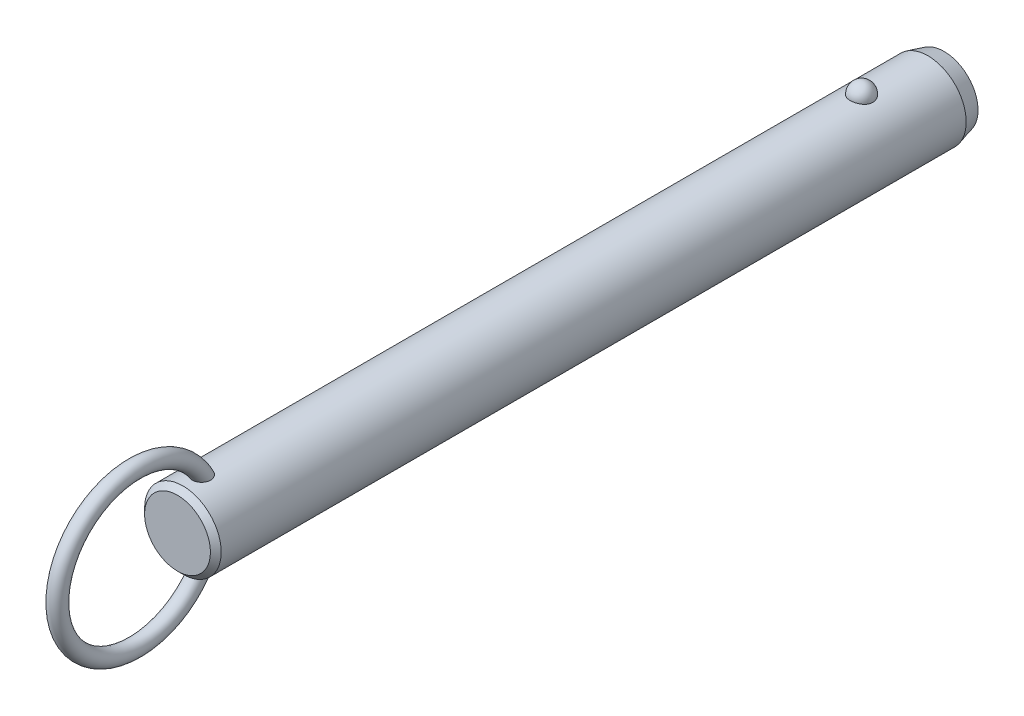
ISO-10303-21;
HEADER;
FILE_DESCRIPTION(('STEP AP214'),'2;1');
FILE_NAME('part.step','',(''),(''),'','','');
FILE_SCHEMA(('AUTOMOTIVE_DESIGN { 1 0 10303 214 1 1 1 1 }'));
ENDSEC;
DATA;
#1=APPLICATION_CONTEXT('core data for automotive mechanical design processes');
#2=APPLICATION_PROTOCOL_DEFINITION('international standard','automotive_design',2000,#1);
#3=PRODUCT_CONTEXT('',#1,'mechanical');
#4=PRODUCT('Part','Part','',(#3));
#5=PRODUCT_RELATED_PRODUCT_CATEGORY('part','',(#4));
#6=PRODUCT_DEFINITION_FORMATION('','',#4);
#7=PRODUCT_DEFINITION_CONTEXT('part definition',#1,'design');
#8=PRODUCT_DEFINITION('design','',#6,#7);
#9=PRODUCT_DEFINITION_SHAPE('','',#8);
#10=(LENGTH_UNIT() NAMED_UNIT(*) SI_UNIT(.MILLI.,.METRE.));
#11=(NAMED_UNIT(*) PLANE_ANGLE_UNIT() SI_UNIT($,.RADIAN.));
#12=(NAMED_UNIT(*) SI_UNIT($,.STERADIAN.) SOLID_ANGLE_UNIT());
#13=UNCERTAINTY_MEASURE_WITH_UNIT(LENGTH_MEASURE(1.E-05),#10,'distance_accuracy_value','');
#14=(GEOMETRIC_REPRESENTATION_CONTEXT(3) GLOBAL_UNCERTAINTY_ASSIGNED_CONTEXT((#13)) GLOBAL_UNIT_ASSIGNED_CONTEXT((#10,
#11,#12)) REPRESENTATION_CONTEXT('',''));
#15=CARTESIAN_POINT('',(0.,0.,0.));
#16=DIRECTION('',(0.,0.,1.));
#17=DIRECTION('',(1.,0.,0.));
#18=AXIS2_PLACEMENT_3D('',#15,#16,#17);
#19=CARTESIAN_POINT('',(0.,0.,116.8));
#20=DIRECTION('',(0.,0.,-1.));
#21=DIRECTION('',(-1.,0.,0.));
#22=AXIS2_PLACEMENT_3D('',#19,#20,#21);
#23=CYLINDRICAL_SURFACE('',#22,7.1);
#24=CARTESIAN_POINT('',(2.0769088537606,6.78943661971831,-2.1));
#25=CARTESIAN_POINT('',(2.07690739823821,6.78943796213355,-1.98268154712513));
#26=CARTESIAN_POINT('',(2.06738130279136,6.79237331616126,-1.86534506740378));
#27=CARTESIAN_POINT('',(2.0295040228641,6.8037853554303,-1.63400788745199));
#28=CARTESIAN_POINT('',(2.00114757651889,6.81226358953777,-1.52000812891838));
#29=CARTESIAN_POINT('',(1.92632025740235,6.83379798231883,-1.29863433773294));
#30=CARTESIAN_POINT('',(1.87985726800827,6.84685214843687,-1.19125744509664));
#31=CARTESIAN_POINT('',(1.76995205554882,6.87608091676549,-0.98604657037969));
#32=CARTESIAN_POINT('',(1.70650980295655,6.8922555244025,-0.88821260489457));
#33=CARTESIAN_POINT('',(1.5638119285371,6.92602930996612,-0.704242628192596));
#34=CARTESIAN_POINT('',(1.4844714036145,6.94363582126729,-0.618173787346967));
#35=CARTESIAN_POINT('',(1.31221746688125,6.97823658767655,-0.460740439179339));
#36=CARTESIAN_POINT('',(1.21930409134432,6.99523084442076,-0.389375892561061));
#37=CARTESIAN_POINT('',(1.02268781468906,7.02666176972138,-0.263547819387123));
#38=CARTESIAN_POINT('',(0.91902009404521,7.04110638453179,-0.209031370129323));
#39=CARTESIAN_POINT('',(0.703548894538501,7.06588726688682,-0.118163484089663));
#40=CARTESIAN_POINT('',(0.591746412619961,7.07622403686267,-0.0818098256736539));
#41=CARTESIAN_POINT('',(0.365557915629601,7.09147068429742,-0.0288711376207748));
#42=CARTESIAN_POINT('',(0.251267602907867,7.09648447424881,-0.0119070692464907));
#43=CARTESIAN_POINT('',(0.0213499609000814,7.10089837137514,0.00304925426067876));
#44=CARTESIAN_POINT('',(-0.0942772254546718,7.10029907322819,0.00104351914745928));
#45=CARTESIAN_POINT('',(-0.321651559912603,7.09360829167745,-0.0216931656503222));
#46=CARTESIAN_POINT('',(-0.433431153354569,7.08760388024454,-0.0421272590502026));
#47=CARTESIAN_POINT('',(-0.651862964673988,7.07086131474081,-0.100729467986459));
#48=CARTESIAN_POINT('',(-0.758515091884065,7.06012307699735,-0.138897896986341));
#49=CARTESIAN_POINT('',(-0.964449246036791,7.03496097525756,-0.232213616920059));
#50=CARTESIAN_POINT('',(-1.06368095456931,7.02051445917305,-0.287465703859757));
#51=CARTESIAN_POINT('',(-1.25145353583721,6.98948740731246,-0.413383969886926));
#52=CARTESIAN_POINT('',(-1.33999321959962,6.97290663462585,-0.48405186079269));
#53=CARTESIAN_POINT('',(-1.50591604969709,6.93898770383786,-0.640594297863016));
#54=CARTESIAN_POINT('',(-1.58302488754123,6.92164094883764,-0.726757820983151));
#55=CARTESIAN_POINT('',(-1.72189320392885,6.8884103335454,-0.91092752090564));
#56=CARTESIAN_POINT('',(-1.78365144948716,6.87252659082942,-1.008934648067));
#57=CARTESIAN_POINT('',(-1.89101272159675,6.84377189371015,-1.21549497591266));
#58=CARTESIAN_POINT('',(-1.93639553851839,6.83094274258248,-1.32416860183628));
#59=CARTESIAN_POINT('',(-2.00874275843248,6.81002070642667,-1.54791500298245));
#60=CARTESIAN_POINT('',(-2.03570774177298,6.80192767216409,-1.66298757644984));
#61=CARTESIAN_POINT('',(-2.07047276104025,6.7914266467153,-1.89571453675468));
#62=CARTESIAN_POINT('',(-2.07835878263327,6.78899315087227,-2.01335491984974));
#63=CARTESIAN_POINT('',(-2.07502083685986,6.79001409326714,-2.24833570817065));
#64=CARTESIAN_POINT('',(-2.06379746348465,6.7934683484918,-2.36567612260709));
#65=CARTESIAN_POINT('',(-2.02263913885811,6.80583442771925,-2.59603194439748));
#66=CARTESIAN_POINT('',(-1.99281127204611,6.81471501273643,-2.70906820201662));
#67=CARTESIAN_POINT('',(-1.91526639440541,6.83691232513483,-2.92836575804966));
#68=CARTESIAN_POINT('',(-1.8675486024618,6.85022924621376,-3.03462676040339));
#69=CARTESIAN_POINT('',(-1.75504492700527,6.87991336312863,-3.23806487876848));
#70=CARTESIAN_POINT('',(-1.69015924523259,6.89629822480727,-3.33518422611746));
#71=CARTESIAN_POINT('',(-1.54505404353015,6.93024852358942,-3.51697105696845));
#72=CARTESIAN_POINT('',(-1.46483385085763,6.94781401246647,-3.60163799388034));
#73=CARTESIAN_POINT('',(-1.29071406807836,6.98225977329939,-3.75654119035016));
#74=CARTESIAN_POINT('',(-1.19675650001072,6.99913673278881,-3.82671308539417));
#75=CARTESIAN_POINT('',(-0.997940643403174,7.03023618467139,-3.9501837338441));
#76=CARTESIAN_POINT('',(-0.89308318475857,7.04445887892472,-4.00348377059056));
#77=CARTESIAN_POINT('',(-0.676902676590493,7.06848365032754,-4.09107242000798));
#78=CARTESIAN_POINT('',(-0.565686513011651,7.0783430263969,-4.12560889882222));
#79=CARTESIAN_POINT('',(-0.338739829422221,7.09282534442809,-4.17575450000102));
#80=CARTESIAN_POINT('',(-0.223009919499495,7.09744899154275,-4.19136617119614));
#81=CARTESIAN_POINT('',(0.00707628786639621,7.10090930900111,-4.20307965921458));
#82=CARTESIAN_POINT('',(0.121410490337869,7.09986531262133,-4.19958377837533));
#83=CARTESIAN_POINT('',(0.347815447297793,7.092380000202,-4.17411564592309));
#84=CARTESIAN_POINT('',(0.459886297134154,7.08593891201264,-4.15214417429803));
#85=CARTESIAN_POINT('',(0.678084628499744,7.06838983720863,-4.09049562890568));
#86=CARTESIAN_POINT('',(0.784237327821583,7.05730369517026,-4.05090137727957));
#87=CARTESIAN_POINT('',(0.988305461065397,7.03163139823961,-3.95511447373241));
#88=CARTESIAN_POINT('',(1.08622031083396,7.01704499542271,-3.89892064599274));
#89=CARTESIAN_POINT('',(1.27284490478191,6.98562668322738,-3.77035541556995));
#90=CARTESIAN_POINT('',(1.36137372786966,6.96876135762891,-3.69772964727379));
#91=CARTESIAN_POINT('',(1.52509486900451,6.93477412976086,-3.53878279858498));
#92=CARTESIAN_POINT('',(1.60028496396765,6.91765218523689,-3.45245943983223));
#93=CARTESIAN_POINT('',(1.73681688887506,6.88465753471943,-3.26658774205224));
#94=CARTESIAN_POINT('',(1.79785966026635,6.86881574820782,-3.16681408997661));
#95=CARTESIAN_POINT('',(1.90265327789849,6.84053157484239,-2.95814408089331));
#96=CARTESIAN_POINT('',(1.94640861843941,6.82808830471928,-2.84925010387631));
#97=CARTESIAN_POINT('',(2.01274378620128,6.80881460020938,-2.63454318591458));
#98=CARTESIAN_POINT('',(2.03676193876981,6.80160856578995,-2.52920574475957));
#99=CARTESIAN_POINT('',(2.06884490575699,6.79191902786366,-2.3159172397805));
#100=CARTESIAN_POINT('',(2.07691019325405,6.78943538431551,-2.20796625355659));
#101=CARTESIAN_POINT('',(2.0769088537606,6.78943661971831,-2.1));
#102=B_SPLINE_CURVE_WITH_KNOTS('',3,(#24,#25,#26,#27,#28,#29,#30,#31,#32,#33,#34,#35,#36,#37,
#38,#39,#40,#41,#42,#43,#44,#45,#46,#47,#48,#49,#50,#51,#52,#53,#54,#55,#56,#57,#58,#59,#60,#61,
#62,#63,#64,#65,#66,#67,#68,#69,#70,#71,#72,#73,#74,#75,#76,#77,#78,#79,#80,#81,#82,#83,#84,#85,
#86,#87,#88,#89,#90,#91,#92,#93,#94,#95,#96,#97,#98,#99,#100,#101),.UNSPECIFIED.,.T.,.F.,(4,2,2,
2,2,2,2,2,2,2,2,2,2,2,2,2,2,2,2,2,2,2,2,2,2,2,2,2,2,2,2,2,2,2,2,2,2,2,4),(0.,0.351568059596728,
0.703234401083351,1.05474780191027,1.40626181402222,1.75970563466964,2.11314851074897,
2.4654696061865,2.81774759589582,3.16301449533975,3.50824481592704,3.84801136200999,
4.18778391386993,4.52968352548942,4.87162112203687,5.22076181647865,5.56993054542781,
5.92363364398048,6.27732559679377,6.62942052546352,6.98150450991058,7.33158042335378,
7.68167162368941,8.03384443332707,8.38603269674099,8.73975272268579,9.09344583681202,
9.44234545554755,9.79119807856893,10.1327344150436,10.4742563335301,10.8141898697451,
11.1541474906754,11.4997793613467,11.8454687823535,12.1979079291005,12.5502553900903,
12.8738073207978,13.1973496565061),.UNSPECIFIED.);
#103=CARTESIAN_POINT('',(2.0769088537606,6.78943661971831,-2.1));
#104=VERTEX_POINT('',#103);
#105=EDGE_CURVE('E41',#104,#104,#102,.T.);
#106=ORIENTED_EDGE('',*,*,#105,.T.);
#107=EDGE_LOOP('',(#106));
#108=FACE_BOUND('',#107,.T.);
#109=CARTESIAN_POINT('',(0.,0.,123.72));
#110=DIRECTION('',(0.,0.,1.));
#111=DIRECTION('',(1.,0.,0.));
#112=AXIS2_PLACEMENT_3D('',#109,#110,#111);
#113=CIRCLE('',#112,7.1);
#114=CARTESIAN_POINT('',(7.1,0.,123.72));
#115=VERTEX_POINT('',#114);
#116=EDGE_CURVE('E10',#115,#115,#113,.F.);
#117=ORIENTED_EDGE('',*,*,#116,.T.);
#118=EDGE_LOOP('',(#117));
#119=FACE_BOUND('',#118,.T.);
#120=CARTESIAN_POINT('',(-0.429539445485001,-7.08699541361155,118.542921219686));
#121=CARTESIAN_POINT('',(-0.508331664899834,-7.08221999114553,118.566876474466));
#122=CARTESIAN_POINT('',(-0.585039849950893,-7.07624016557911,118.597457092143));
#123=CARTESIAN_POINT('',(-0.732082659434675,-7.06254296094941,118.671024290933));
#124=CARTESIAN_POINT('',(-0.802417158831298,-7.05482554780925,118.714011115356));
#125=CARTESIAN_POINT('',(-0.934722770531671,-7.03851844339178,118.811113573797));
#126=CARTESIAN_POINT('',(-0.996700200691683,-7.02992941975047,118.865220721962));
#127=CARTESIAN_POINT('',(-1.11079942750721,-7.01280697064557,118.982967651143));
#128=CARTESIAN_POINT('',(-1.16292136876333,-7.00427354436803,119.046607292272));
#129=CARTESIAN_POINT('',(-1.25705660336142,-6.98799959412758,119.182687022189));
#130=CARTESIAN_POINT('',(-1.2988803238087,-6.98027525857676,119.255259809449));
#131=CARTESIAN_POINT('',(-1.37069920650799,-6.96652886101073,119.406168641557));
#132=CARTESIAN_POINT('',(-1.40069157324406,-6.96050720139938,119.484506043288));
#133=CARTESIAN_POINT('',(-1.45043507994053,-6.95031881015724,119.650190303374));
#134=CARTESIAN_POINT('',(-1.46937115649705,-6.94630231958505,119.737789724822));
#135=CARTESIAN_POINT('',(-1.49424917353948,-6.94099239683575,119.914871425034));
#136=CARTESIAN_POINT('',(-1.50018601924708,-6.93970003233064,120.004354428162));
#137=CARTESIAN_POINT('',(-1.49978214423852,-6.93978815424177,120.194060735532));
#138=CARTESIAN_POINT('',(-1.49187639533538,-6.94150934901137,120.294279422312));
#139=CARTESIAN_POINT('',(-1.46177925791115,-6.94790814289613,120.492479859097));
#140=CARTESIAN_POINT('',(-1.43957541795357,-6.95258831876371,120.590459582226));
#141=CARTESIAN_POINT('',(-1.37783293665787,-6.96510647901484,120.79536292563));
#142=CARTESIAN_POINT('',(-1.33634073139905,-6.97328848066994,120.901680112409));
#143=CARTESIAN_POINT('',(-1.23686994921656,-6.99161706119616,121.106177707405));
#144=CARTESIAN_POINT('',(-1.17889192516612,-7.00176357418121,121.204358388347));
#145=CARTESIAN_POINT('',(-1.05875124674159,-7.02082898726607,121.372374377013));
#146=CARTESIAN_POINT('',(-0.999247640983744,-7.02963746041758,121.444123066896));
#147=CARTESIAN_POINT('',(-0.869494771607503,-7.04686074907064,121.577195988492));
#148=CARTESIAN_POINT('',(-0.799263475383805,-7.05527619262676,121.638537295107));
#149=CARTESIAN_POINT('',(-0.665408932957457,-7.06899457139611,121.735131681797));
#150=CARTESIAN_POINT('',(-0.603817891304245,-7.07457275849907,121.773151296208));
#151=CARTESIAN_POINT('',(-0.47517283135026,-7.08437420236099,121.838758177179));
#152=CARTESIAN_POINT('',(-0.408123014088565,-7.08859848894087,121.866353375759));
#153=CARTESIAN_POINT('',(-0.269431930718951,-7.09522749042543,121.909256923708));
#154=CARTESIAN_POINT('',(-0.19775731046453,-7.09761688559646,121.924461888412));
#155=CARTESIAN_POINT('',(-0.05278498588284,-7.10017268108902,121.940716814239));
#156=CARTESIAN_POINT('',(0.0205115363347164,-7.10034065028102,121.941776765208));
#157=CARTESIAN_POINT('',(0.156426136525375,-7.09855986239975,121.930461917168));
#158=CARTESIAN_POINT('',(0.219199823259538,-7.09688191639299,121.919806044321));
#159=CARTESIAN_POINT('',(0.342134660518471,-7.09201880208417,121.888537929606));
#160=CARTESIAN_POINT('',(0.402295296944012,-7.08883333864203,121.867923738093));
#161=CARTESIAN_POINT('',(0.520687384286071,-7.08113868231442,121.817212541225));
#162=CARTESIAN_POINT('',(0.57879126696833,-7.07658958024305,121.786827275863));
#163=CARTESIAN_POINT('',(0.690173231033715,-7.06659708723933,121.718367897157));
#164=CARTESIAN_POINT('',(0.74344785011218,-7.061153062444,121.680288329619));
#165=CARTESIAN_POINT('',(0.870947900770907,-7.04680292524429,121.576592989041));
#166=CARTESIAN_POINT('',(0.941828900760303,-7.0375580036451,121.506897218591));
#167=CARTESIAN_POINT('',(1.07136606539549,-7.01900793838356,121.356945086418));
#168=CARTESIAN_POINT('',(1.13000013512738,-7.00970271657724,121.276670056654));
#169=CARTESIAN_POINT('',(1.23579584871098,-6.99183327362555,121.106899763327));
#170=CARTESIAN_POINT('',(1.28274271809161,-6.98328455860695,121.017269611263));
#171=CARTESIAN_POINT('',(1.36351442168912,-6.96796352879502,120.832176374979));
#172=CARTESIAN_POINT('',(1.39733971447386,-6.96119115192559,120.736713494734));
#173=CARTESIAN_POINT('',(1.45579181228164,-6.94922464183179,120.52530928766));
#174=CARTESIAN_POINT('',(1.47790145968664,-6.94449000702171,120.408631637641));
#175=CARTESIAN_POINT('',(1.50168752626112,-6.93938731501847,120.173015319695));
#176=CARTESIAN_POINT('',(1.50336085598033,-6.93901991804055,120.05407631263));
#177=CARTESIAN_POINT('',(1.48486516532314,-6.9430010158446,119.82360799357));
#178=CARTESIAN_POINT('',(1.46573441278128,-6.9471253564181,119.711995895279));
#179=CARTESIAN_POINT('',(1.40606892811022,-6.95944667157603,119.494886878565));
#180=CARTESIAN_POINT('',(1.36556446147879,-6.96763788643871,119.3893815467));
#181=CARTESIAN_POINT('',(1.27082700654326,-6.98548038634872,119.204287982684));
#182=CARTESIAN_POINT('',(1.21949810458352,-6.99473841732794,119.123171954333));
#183=CARTESIAN_POINT('',(1.10242050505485,-7.01414069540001,118.972227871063));
#184=CARTESIAN_POINT('',(1.0366811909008,-7.02428436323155,118.90239252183));
#185=CARTESIAN_POINT('',(0.900559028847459,-7.04295285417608,118.783573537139));
#186=CARTESIAN_POINT('',(0.831428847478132,-7.05153466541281,118.733157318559));
#187=CARTESIAN_POINT('',(0.685291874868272,-7.06723150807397,118.645142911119));
#188=CARTESIAN_POINT('',(0.608287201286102,-7.0743469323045,118.607541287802));
#189=CARTESIAN_POINT('',(0.45187890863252,-7.08602232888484,118.547491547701));
#190=CARTESIAN_POINT('',(0.372686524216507,-7.09067127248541,118.524508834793));
#191=CARTESIAN_POINT('',(0.211477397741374,-7.09730788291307,118.492035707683));
#192=CARTESIAN_POINT('',(0.12946098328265,-7.09929585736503,118.48254373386));
#193=CARTESIAN_POINT('',(-0.0332905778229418,-7.10037858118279,118.477351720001));
#194=CARTESIAN_POINT('',(-0.114016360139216,-7.09953334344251,118.481365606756));
#195=CARTESIAN_POINT('',(-0.273670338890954,-7.09517338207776,118.502454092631));
#196=CARTESIAN_POINT('',(-0.352598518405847,-7.09165863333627,118.519528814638));
#197=CARTESIAN_POINT('',(-0.429539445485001,-7.08699541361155,118.542921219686));
#198=B_SPLINE_CURVE_WITH_KNOTS('',3,(#120,#121,#122,#123,#124,#125,#126,#127,#128,#129,#130,
#131,#132,#133,#134,#135,#136,#137,#138,#139,#140,#141,#142,#143,#144,#145,#146,#147,#148,#149,
#150,#151,#152,#153,#154,#155,#156,#157,#158,#159,#160,#161,#162,#163,#164,#165,#166,#167,#168,
#169,#170,#171,#172,#173,#174,#175,#176,#177,#178,#179,#180,#181,#182,#183,#184,#185,#186,#187,
#188,#189,#190,#191,#192,#193,#194,#195,#196,#197),.UNSPECIFIED.,.T.,.F.,(4,2,2,2,2,2,2,2,2,2,2,
2,2,2,2,2,2,2,2,2,2,2,2,2,2,2,2,2,2,2,2,2,2,2,2,2,2,2,4),(0.,0.247183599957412,
0.494372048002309,0.741372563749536,0.988369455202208,1.23962059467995,1.49093106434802,
1.75897818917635,2.02713035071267,2.32758265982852,2.62829697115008,2.97008736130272,
3.31186629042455,3.59175319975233,3.87117637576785,4.08813841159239,4.30493502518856,
4.52352259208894,4.7419557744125,4.93215328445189,5.12238804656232,5.31884850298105,
5.51544871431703,5.81332317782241,6.11173048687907,6.41527266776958,6.71880423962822,
7.073581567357,7.42841252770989,7.76631485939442,8.10373999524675,8.39142246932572,
8.67891817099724,8.9356033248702,9.19221962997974,9.43881106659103,9.68537399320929,
9.92674752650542,10.1681233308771),.UNSPECIFIED.);
#199=CARTESIAN_POINT('',(-0.429539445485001,-7.08699541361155,118.542921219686));
#200=VERTEX_POINT('',#199);
#201=EDGE_CURVE('E58',#200,#200,#198,.T.);
#202=ORIENTED_EDGE('',*,*,#201,.T.);
#203=EDGE_LOOP('',(#202));
#204=FACE_BOUND('',#203,.T.);
#205=CARTESIAN_POINT('',(-0.429539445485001,7.08699541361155,118.542921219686));
#206=CARTESIAN_POINT('',(-0.351665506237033,7.09171429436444,118.519246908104));
#207=CARTESIAN_POINT('',(-0.271733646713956,7.09525896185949,118.502036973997));
#208=CARTESIAN_POINT('',(-0.11002645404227,7.09960839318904,118.481005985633));
#209=CARTESIAN_POINT('',(-0.0282502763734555,7.10041187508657,118.477191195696));
#210=CARTESIAN_POINT('',(0.134782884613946,7.09918849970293,118.483059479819));
#211=CARTESIAN_POINT('',(0.21603995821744,7.09716214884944,118.49274013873));
#212=CARTESIAN_POINT('',(0.375730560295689,7.09050177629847,118.525347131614));
#213=CARTESIAN_POINT('',(0.454164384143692,7.08586802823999,118.548272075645));
#214=CARTESIAN_POINT('',(0.606025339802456,7.07449911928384,118.606771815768));
#215=CARTESIAN_POINT('',(0.679451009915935,7.06776334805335,118.642350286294));
#216=CARTESIAN_POINT('',(0.819234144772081,7.05292866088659,118.725175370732));
#217=CARTESIAN_POINT('',(0.885591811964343,7.04482978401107,118.772421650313));
#218=CARTESIAN_POINT('',(1.00993211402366,7.02808709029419,118.877590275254));
#219=CARTESIAN_POINT('',(1.06785399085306,7.01943990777,118.935583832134));
#220=CARTESIAN_POINT('',(1.17342527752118,7.00256662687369,119.060301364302));
#221=CARTESIAN_POINT('',(1.22107408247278,6.99434055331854,119.127025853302));
#222=CARTESIAN_POINT('',(1.30652927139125,6.97889183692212,119.269362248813));
#223=CARTESIAN_POINT('',(1.34399711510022,6.97170674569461,119.345180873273));
#224=CARTESIAN_POINT('',(1.40682616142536,6.95930080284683,119.501810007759));
#225=CARTESIAN_POINT('',(1.43218374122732,6.95408053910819,119.58262200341));
#226=CARTESIAN_POINT('',(1.47246409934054,6.94566853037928,119.753531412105));
#227=CARTESIAN_POINT('',(1.48642590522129,6.9426653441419,119.84386307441));
#228=CARTESIAN_POINT('',(1.5011410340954,6.93949744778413,120.025619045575));
#229=CARTESIAN_POINT('',(1.50188917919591,6.93933385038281,120.117043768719));
#230=CARTESIAN_POINT('',(1.49030464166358,6.94183245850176,120.31084381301));
#231=CARTESIAN_POINT('',(1.47627413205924,6.94486147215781,120.413112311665));
#232=CARTESIAN_POINT('',(1.43356351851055,6.95380194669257,120.614471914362));
#233=CARTESIAN_POINT('',(1.4048676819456,6.95971650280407,120.713559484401));
#234=CARTESIAN_POINT('',(1.32908750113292,6.97461208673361,120.918908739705));
#235=CARTESIAN_POINT('',(1.28011435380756,6.98388945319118,121.024456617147));
#236=CARTESIAN_POINT('',(1.16520357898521,7.00397743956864,121.225760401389));
#237=CARTESIAN_POINT('',(1.09927694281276,7.01478706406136,121.321522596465));
#238=CARTESIAN_POINT('',(0.969361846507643,7.03373936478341,121.476756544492));
#239=CARTESIAN_POINT('',(0.909042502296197,7.04187023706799,121.539303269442));
#240=CARTESIAN_POINT('',(0.779178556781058,7.05741732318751,121.654053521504));
#241=CARTESIAN_POINT('',(0.709649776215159,7.06483472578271,121.706274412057));
#242=CARTESIAN_POINT('',(0.576854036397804,7.0767751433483,121.788113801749));
#243=CARTESIAN_POINT('',(0.515118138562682,7.08158033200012,121.820164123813));
#244=CARTESIAN_POINT('',(0.387127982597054,7.08972701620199,121.873765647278));
#245=CARTESIAN_POINT('',(0.320877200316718,7.09306962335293,121.895324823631));
#246=CARTESIAN_POINT('',(0.18504126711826,7.09791507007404,121.926400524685));
#247=CARTESIAN_POINT('',(0.115437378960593,7.09940591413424,121.935838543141));
#248=CARTESIAN_POINT('',(-0.0243157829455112,7.10030171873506,121.941522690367));
#249=CARTESIAN_POINT('',(-0.0944648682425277,7.0997073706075,121.937773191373));
#250=CARTESIAN_POINT('',(-0.225713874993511,7.09668414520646,121.918508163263));
#251=CARTESIAN_POINT('',(-0.287006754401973,7.09444865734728,121.904232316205));
#252=CARTESIAN_POINT('',(-0.40655537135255,7.08860360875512,121.866368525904));
#253=CARTESIAN_POINT('',(-0.464809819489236,7.08499346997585,121.842776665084));
#254=CARTESIAN_POINT('',(-0.594955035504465,7.07541654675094,121.778923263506));
#255=CARTESIAN_POINT('',(-0.665389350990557,7.06906574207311,121.735753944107));
#256=CARTESIAN_POINT('',(-0.798242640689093,7.05530261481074,121.638587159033));
#257=CARTESIAN_POINT('',(-0.860645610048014,7.0478882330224,121.584568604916));
#258=CARTESIAN_POINT('',(-0.99424943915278,7.03045217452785,121.450996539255));
#259=CARTESIAN_POINT('',(-1.06260129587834,7.02030745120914,121.368614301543));
#260=CARTESIAN_POINT('',(-1.18502045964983,7.00068382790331,121.193843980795));
#261=CARTESIAN_POINT('',(-1.239076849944,6.99120544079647,121.101448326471));
#262=CARTESIAN_POINT('',(-1.33335589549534,6.97384343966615,120.908008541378));
#263=CARTESIAN_POINT('',(-1.3733613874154,6.96598557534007,120.806856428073));
#264=CARTESIAN_POINT('',(-1.43770677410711,6.9529905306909,120.599504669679));
#265=CARTESIAN_POINT('',(-1.46204473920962,6.94785368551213,120.49330440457));
#266=CARTESIAN_POINT('',(-1.49537533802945,6.94076296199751,120.268231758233));
#267=CARTESIAN_POINT('',(-1.50273564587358,6.93914842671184,120.14909751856));
#268=CARTESIAN_POINT('',(-1.4954555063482,6.94072368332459,119.911470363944));
#269=CARTESIAN_POINT('',(-1.48082914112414,6.94391040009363,119.792977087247));
#270=CARTESIAN_POINT('',(-1.43076401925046,6.95438579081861,119.573432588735));
#271=CARTESIAN_POINT('',(-1.39762227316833,6.96121852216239,119.471841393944));
#272=CARTESIAN_POINT('',(-1.31211274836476,6.97783941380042,119.277351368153));
#273=CARTESIAN_POINT('',(-1.2597660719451,6.98762432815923,119.18444313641));
#274=CARTESIAN_POINT('',(-1.14583073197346,7.00713153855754,119.024160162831));
#275=CARTESIAN_POINT('',(-1.0866594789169,7.01665982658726,118.955035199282));
#276=CARTESIAN_POINT('',(-0.956606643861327,7.03556646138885,118.828878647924));
#277=CARTESIAN_POINT('',(-0.885737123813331,7.04494495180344,118.771834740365));
#278=CARTESIAN_POINT('',(-0.751558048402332,7.06035735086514,118.683100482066));
#279=CARTESIAN_POINT('',(-0.690120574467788,7.0666695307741,118.648593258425));
#280=CARTESIAN_POINT('',(-0.562815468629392,7.07794609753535,118.588750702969));
#281=CARTESIAN_POINT('',(-0.496948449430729,7.08291067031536,118.563414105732));
#282=CARTESIAN_POINT('',(-0.429539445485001,7.08699541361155,118.542921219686));
#283=B_SPLINE_CURVE_WITH_KNOTS('',3,(#205,#206,#207,#208,#209,#210,#211,#212,#213,#214,#215,
#216,#217,#218,#219,#220,#221,#222,#223,#224,#225,#226,#227,#228,#229,#230,#231,#232,#233,#234,
#235,#236,#237,#238,#239,#240,#241,#242,#243,#244,#245,#246,#247,#248,#249,#250,#251,#252,#253,
#254,#255,#256,#257,#258,#259,#260,#261,#262,#263,#264,#265,#266,#267,#268,#269,#270,#271,#272,
#273,#274,#275,#276,#277,#278,#279,#280,#281,#282),.UNSPECIFIED.,.T.,.F.,(4,2,2,2,2,2,2,2,2,2,2,
2,2,2,2,2,2,2,2,2,2,2,2,2,2,2,2,2,2,2,2,2,2,2,2,2,2,2,4),(0.,0.244335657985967,
0.488785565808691,0.73319173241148,0.977572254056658,1.22202379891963,1.46646834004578,
1.71259457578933,1.95873529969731,2.21226768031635,2.46587585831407,2.73913816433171,
3.01250754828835,3.32109936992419,3.63002293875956,3.9786351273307,4.32702187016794,
4.58793945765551,4.84841449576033,5.05676704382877,5.26496096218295,5.47449661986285,
5.68396281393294,5.8720544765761,6.06022532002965,6.30743751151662,6.55513496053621,
6.87602468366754,7.19715875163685,7.52305774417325,7.84899686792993,8.20516155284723,
8.56109821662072,8.88040084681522,9.19935367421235,9.47236282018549,9.74509220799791,
9.95662250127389,10.1681235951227),.UNSPECIFIED.);
#284=CARTESIAN_POINT('',(-0.429539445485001,7.08699541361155,118.542921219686));
#285=VERTEX_POINT('',#284);
#286=EDGE_CURVE('E66',#285,#285,#283,.T.);
#287=ORIENTED_EDGE('',*,*,#286,.T.);
#288=EDGE_LOOP('',(#287));
#289=FACE_BOUND('',#288,.T.);
#290=CARTESIAN_POINT('',(0.,0.,-14.3999999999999));
#291=DIRECTION('',(0.,0.,-1.));
#292=DIRECTION('',(-1.,0.,0.));
#293=AXIS2_PLACEMENT_3D('',#290,#291,#292);
#294=CIRCLE('',#293,7.1);
#295=CARTESIAN_POINT('',(-7.1,0.,-14.3999999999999));
#296=VERTEX_POINT('',#295);
#297=EDGE_CURVE('E55',#296,#296,#294,.F.);
#298=ORIENTED_EDGE('',*,*,#297,.T.);
#299=EDGE_LOOP('',(#298));
#300=FACE_BOUND('',#299,.T.);
#301=ADVANCED_FACE('F37',(#108,#119,#204,#289,#300),#23,.T.);
#302=CARTESIAN_POINT('',(0.,0.,-17.4));
#303=DIRECTION('',(0.,0.,-1.));
#304=DIRECTION('',(-1.,0.,0.));
#305=AXIS2_PLACEMENT_3D('',#302,#303,#304);
#306=PLANE('',#305);
#307=CARTESIAN_POINT('',(0.,0.,-17.4));
#308=DIRECTION('',(0.,0.,-1.));
#309=DIRECTION('',(-1.,0.,0.));
#310=AXIS2_PLACEMENT_3D('',#307,#308,#309);
#311=CIRCLE('',#310,6.29615242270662);
#312=CARTESIAN_POINT('',(-6.29615242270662,0.,-17.4));
#313=VERTEX_POINT('',#312);
#314=EDGE_CURVE('E65',#313,#313,#311,.T.);
#315=ORIENTED_EDGE('',*,*,#314,.T.);
#316=EDGE_LOOP('',(#315));
#317=FACE_BOUND('',#316,.T.);
#318=ADVANCED_FACE('F84',(#317),#306,.T.);
#319=CARTESIAN_POINT('',(0.,0.,-17.4));
#320=DIRECTION('',(0.,0.,1.));
#321=DIRECTION('',(1.,0.,0.));
#322=AXIS2_PLACEMENT_3D('',#319,#320,#321);
#323=CONICAL_SURFACE('',#322,6.29615242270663,0.261799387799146);
#324=ORIENTED_EDGE('',*,*,#297,.F.);
#325=EDGE_LOOP('',(#324));
#326=FACE_BOUND('',#325,.T.);
#327=ORIENTED_EDGE('',*,*,#314,.F.);
#328=EDGE_LOOP('',(#327));
#329=FACE_BOUND('',#328,.T.);
#330=ADVANCED_FACE('F82',(#326,#329),#323,.T.);
#331=CARTESIAN_POINT('',(0.,0.,124.72));
#332=DIRECTION('',(0.,0.,1.));
#333=DIRECTION('',(1.,0.,0.));
#334=AXIS2_PLACEMENT_3D('',#331,#332,#333);
#335=PLANE('',#334);
#336=CARTESIAN_POINT('',(0.,0.,124.72));
#337=DIRECTION('',(0.,0.,1.));
#338=DIRECTION('',(1.,0.,0.));
#339=AXIS2_PLACEMENT_3D('',#336,#337,#338);
#340=CIRCLE('',#339,6.10000000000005);
#341=CARTESIAN_POINT('',(6.10000000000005,0.,124.72));
#342=VERTEX_POINT('',#341);
#343=EDGE_CURVE('E50',#342,#342,#340,.T.);
#344=ORIENTED_EDGE('',*,*,#343,.T.);
#345=EDGE_LOOP('',(#344));
#346=FACE_BOUND('',#345,.T.);
#347=ADVANCED_FACE('F76',(#346),#335,.T.);
#348=CARTESIAN_POINT('',(0.,0.,132.65));
#349=DIRECTION('',(1.,0.,0.));
#350=DIRECTION('',(0.,0.,-1.));
#351=AXIS2_PLACEMENT_3D('',#348,#349,#350);
#352=TOROIDAL_SURFACE('',#351,14.35,1.5);
#353=ORIENTED_EDGE('',*,*,#286,.F.);
#354=EDGE_LOOP('',(#353));
#355=FACE_BOUND('',#354,.T.);
#356=ORIENTED_EDGE('',*,*,#201,.F.);
#357=EDGE_LOOP('',(#356));
#358=FACE_BOUND('',#357,.T.);
#359=ADVANCED_FACE('F72',(#355,#358),#352,.T.);
#360=CARTESIAN_POINT('',(0.,0.,124.72));
#361=DIRECTION('',(0.,0.,-1.));
#362=DIRECTION('',(-1.,0.,0.));
#363=AXIS2_PLACEMENT_3D('',#360,#361,#362);
#364=CONICAL_SURFACE('',#363,6.10000000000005,0.785398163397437);
#365=ORIENTED_EDGE('',*,*,#116,.F.);
#366=EDGE_LOOP('',(#365));
#367=FACE_BOUND('',#366,.T.);
#368=ORIENTED_EDGE('',*,*,#343,.F.);
#369=EDGE_LOOP('',(#368));
#370=FACE_BOUND('',#369,.T.);
#371=ADVANCED_FACE('F39',(#367,#370),#364,.T.);
#372=CARTESIAN_POINT('',(0.,7.1,-2.1));
#373=DIRECTION('',(0.,1.,0.));
#374=DIRECTION('',(0.,0.,1.));
#375=AXIS2_PLACEMENT_3D('',#372,#373,#374);
#376=SPHERICAL_SURFACE('',#375,2.10000000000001);
#377=ORIENTED_EDGE('',*,*,#105,.F.);
#378=EDGE_LOOP('',(#377));
#379=FACE_BOUND('',#378,.T.);
#380=ADVANCED_FACE('F78',(#379),#376,.T.);
#381=CLOSED_SHELL('',(#301,#318,#330,#347,#359,#371,#380));
#382=MANIFOLD_SOLID_BREP('B2',#381);
#383=ADVANCED_BREP_SHAPE_REPRESENTATION('',(#18,#382),#14);
#384=SHAPE_DEFINITION_REPRESENTATION(#9,#383);
ENDSEC;
END-ISO-10303-21;
